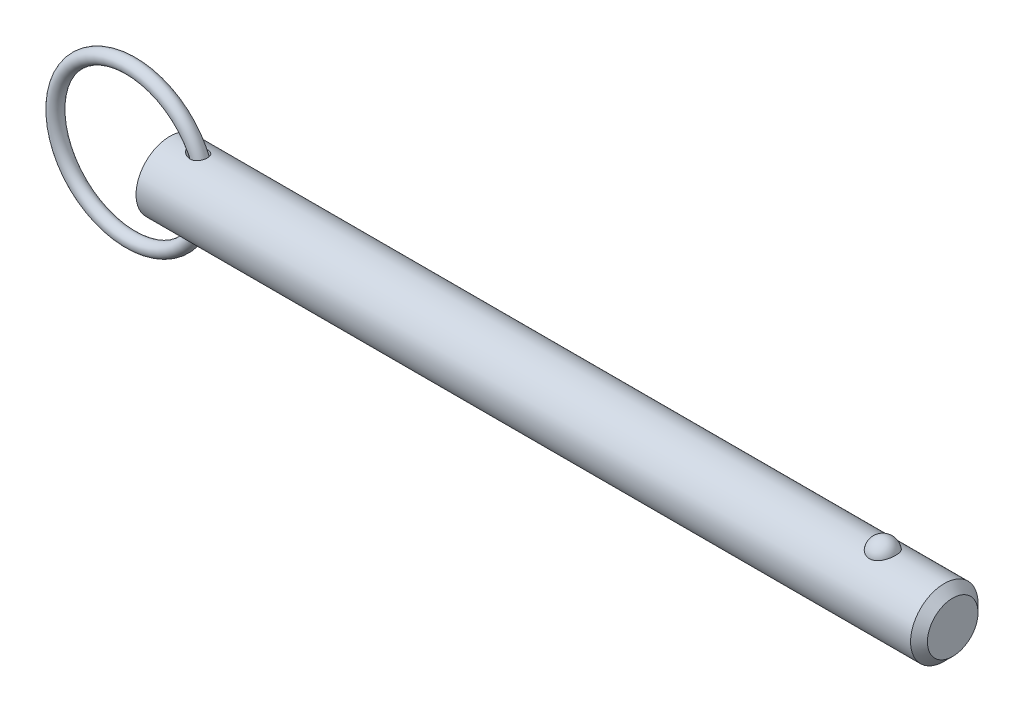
ISO-10303-21;
HEADER;
FILE_DESCRIPTION(('STEP AP214'),'2;1');
FILE_NAME('part.step','',(''),(''),'','','');
FILE_SCHEMA(('AUTOMOTIVE_DESIGN { 1 0 10303 214 1 1 1 1 }'));
ENDSEC;
DATA;
#1=APPLICATION_CONTEXT('core data for automotive mechanical design processes');
#2=APPLICATION_PROTOCOL_DEFINITION('international standard','automotive_design',2000,#1);
#3=PRODUCT_CONTEXT('',#1,'mechanical');
#4=PRODUCT('Part','Part','',(#3));
#5=PRODUCT_RELATED_PRODUCT_CATEGORY('part','',(#4));
#6=PRODUCT_DEFINITION_FORMATION('','',#4);
#7=PRODUCT_DEFINITION_CONTEXT('part definition',#1,'design');
#8=PRODUCT_DEFINITION('design','',#6,#7);
#9=PRODUCT_DEFINITION_SHAPE('','',#8);
#10=(LENGTH_UNIT() NAMED_UNIT(*) SI_UNIT(.MILLI.,.METRE.));
#11=(NAMED_UNIT(*) PLANE_ANGLE_UNIT() SI_UNIT($,.RADIAN.));
#12=(NAMED_UNIT(*) SI_UNIT($,.STERADIAN.) SOLID_ANGLE_UNIT());
#13=UNCERTAINTY_MEASURE_WITH_UNIT(LENGTH_MEASURE(1.E-05),#10,'distance_accuracy_value','');
#14=(GEOMETRIC_REPRESENTATION_CONTEXT(3) GLOBAL_UNCERTAINTY_ASSIGNED_CONTEXT((#13)) GLOBAL_UNIT_ASSIGNED_CONTEXT((#10,
#11,#12)) REPRESENTATION_CONTEXT('',''));
#15=CARTESIAN_POINT('',(0.,0.,0.));
#16=DIRECTION('',(0.,0.,1.));
#17=DIRECTION('',(1.,0.,0.));
#18=AXIS2_PLACEMENT_3D('',#15,#16,#17);
#19=CARTESIAN_POINT('',(-8.23730968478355,0.,0.));
#20=DIRECTION('',(0.,0.,1.));
#21=DIRECTION('',(1.,0.,0.));
#22=AXIS2_PLACEMENT_3D('',#19,#20,#21);
#23=TOROIDAL_SURFACE('',#22,15.875,1.422);
#24=CARTESIAN_POINT('',(9.05969031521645,0.,0.));
#25=VERTEX_POINT('',#24);
#26=VERTEX_LOOP('',#25);
#27=FACE_BOUND('',#26,.T.);
#28=ADVANCED_FACE('P0_F12',(#27),#23,.T.);
#29=CLOSED_SHELL('',(#28));
#30=MANIFOLD_SOLID_BREP('P0_B1',#29);
#31=CARTESIAN_POINT('',(0.,0.,0.));
#32=DIRECTION('',(1.,0.,0.));
#33=DIRECTION('',(0.,0.,-1.));
#34=AXIS2_PLACEMENT_3D('',#31,#32,#33);
#35=CYLINDRICAL_SURFACE('',#34,7.11);
#36=CARTESIAN_POINT('',(3.98467340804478,7.10072679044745,-0.363013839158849));
#37=CARTESIAN_POINT('',(4.00971652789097,7.09600153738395,-0.45539194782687));
#38=CARTESIAN_POINT('',(4.04401947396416,7.08958406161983,-0.545230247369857));
#39=CARTESIAN_POINT('',(4.12810160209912,7.07427055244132,-0.717157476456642));
#40=CARTESIAN_POINT('',(4.17791765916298,7.06536861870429,-0.799227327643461));
#41=CARTESIAN_POINT('',(4.28924471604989,7.04620300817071,-0.953469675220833));
#42=CARTESIAN_POINT('',(4.35063580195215,7.035953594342,-1.02573162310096));
#43=CARTESIAN_POINT('',(4.48282610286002,7.01493313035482,-1.16081412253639));
#44=CARTESIAN_POINT('',(4.55362244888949,7.00416223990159,-1.22363754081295));
#45=CARTESIAN_POINT('',(4.71659336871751,6.98090398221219,-1.35055080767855));
#46=CARTESIAN_POINT('',(4.81029272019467,6.96847103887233,-1.41269256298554));
#47=CARTESIAN_POINT('',(5.0057240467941,6.94515366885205,-1.52319699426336));
#48=CARTESIAN_POINT('',(5.10746392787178,6.93427079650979,-1.57154588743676));
#49=CARTESIAN_POINT('',(5.33503739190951,6.91346066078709,-1.66091325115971));
#50=CARTESIAN_POINT('',(5.46199550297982,6.90402388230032,-1.69921932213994));
#51=CARTESIAN_POINT('',(5.72084799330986,6.89024030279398,-1.75428261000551));
#52=CARTESIAN_POINT('',(5.85274301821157,6.88589416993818,-1.77103699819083));
#53=CARTESIAN_POINT('',(6.11557710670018,6.88337277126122,-1.78081990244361));
#54=CARTESIAN_POINT('',(6.24650031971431,6.88510489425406,-1.77420448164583));
#55=CARTESIAN_POINT('',(6.50446311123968,6.89478744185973,-1.73620392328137));
#56=CARTESIAN_POINT('',(6.6315075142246,6.90272978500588,-1.70485097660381));
#57=CARTESIAN_POINT('',(6.85933269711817,6.92243075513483,-1.62281888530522));
#58=CARTESIAN_POINT('',(6.96133251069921,6.93352131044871,-1.5753580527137));
#59=CARTESIAN_POINT('',(7.15436649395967,6.95824811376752,-1.46226310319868));
#60=CARTESIAN_POINT('',(7.24540699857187,6.97188287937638,-1.3966395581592));
#61=CARTESIAN_POINT('',(7.40446019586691,6.99838217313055,-1.25668991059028));
#62=CARTESIAN_POINT('',(7.473875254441,7.01118308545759,-1.18393777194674));
#63=CARTESIAN_POINT('',(7.59904891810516,7.03582803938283,-1.02736918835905));
#64=CARTESIAN_POINT('',(7.65481029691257,7.04767227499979,-0.943554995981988));
#65=CARTESIAN_POINT('',(7.74982438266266,7.06873077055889,-0.76979592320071));
#66=CARTESIAN_POINT('',(7.7894903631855,7.07800861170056,-0.680084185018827));
#67=CARTESIAN_POINT('',(7.85354088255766,7.09334756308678,-0.495102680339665));
#68=CARTESIAN_POINT('',(7.87792559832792,7.09940871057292,-0.399832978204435));
#69=CARTESIAN_POINT('',(7.9108898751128,7.10766731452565,-0.206294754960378));
#70=CARTESIAN_POINT('',(7.91944662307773,7.10985919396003,-0.108022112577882));
#71=CARTESIAN_POINT('',(7.920501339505,7.11012756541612,0.0886168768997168));
#72=CARTESIAN_POINT('',(7.91299895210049,7.10820396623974,0.186983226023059));
#73=CARTESIAN_POINT('',(7.88205794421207,7.10043733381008,0.381270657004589));
#74=CARTESIAN_POINT('',(7.85857985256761,7.09458459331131,0.477185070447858));
#75=CARTESIAN_POINT('',(7.79617406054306,7.07958431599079,0.663575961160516));
#76=CARTESIAN_POINT('',(7.75724672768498,7.07043685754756,0.754052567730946));
#77=CARTESIAN_POINT('',(7.66496731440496,7.04987259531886,0.926798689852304));
#78=CARTESIAN_POINT('',(7.61164530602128,7.0384605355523,1.00908483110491));
#79=CARTESIAN_POINT('',(7.49191707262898,7.01461776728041,1.16333092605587));
#80=CARTESIAN_POINT('',(7.42551210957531,7.00218715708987,1.235291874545));
#81=CARTESIAN_POINT('',(7.28164031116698,6.97770944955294,1.36680167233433));
#82=CARTESIAN_POINT('',(7.20420170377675,6.96566146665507,1.42638126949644));
#83=CARTESIAN_POINT('',(7.0403906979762,6.94319963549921,1.53199377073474));
#84=CARTESIAN_POINT('',(6.95401827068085,6.93278579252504,1.57802663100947));
#85=CARTESIAN_POINT('',(6.7731858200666,6.91444459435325,1.65656940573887));
#86=CARTESIAN_POINT('',(6.67860569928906,6.90656682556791,1.68881327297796));
#87=CARTESIAN_POINT('',(6.48544119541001,6.89422806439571,1.73849768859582));
#88=CARTESIAN_POINT('',(6.38685561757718,6.88976809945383,1.755933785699));
#89=CARTESIAN_POINT('',(6.18089829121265,6.88429907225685,1.77726234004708));
#90=CARTESIAN_POINT('',(6.07340937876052,6.88356485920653,1.78007646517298));
#91=CARTESIAN_POINT('',(5.85921220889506,6.886086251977,1.77029087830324));
#92=CARTESIAN_POINT('',(5.75250426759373,6.88934339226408,1.75768523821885));
#93=CARTESIAN_POINT('',(5.52848027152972,6.89994454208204,1.71563399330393));
#94=CARTESIAN_POINT('',(5.41155168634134,6.90775772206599,1.68424184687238));
#95=CARTESIAN_POINT('',(5.18376466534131,6.92670168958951,1.60454711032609));
#96=CARTESIAN_POINT('',(5.07291446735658,6.9378368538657,1.5562221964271));
#97=CARTESIAN_POINT('',(4.84835244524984,6.96347168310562,1.43744827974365));
#98=CARTESIAN_POINT('',(4.73562531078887,6.97820486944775,1.36517310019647));
#99=CARTESIAN_POINT('',(4.52504912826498,7.00822340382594,1.20158053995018));
#100=CARTESIAN_POINT('',(4.42717478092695,7.02350775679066,1.11029618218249));
#101=CARTESIAN_POINT('',(4.27935716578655,7.04784659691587,0.940654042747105));
#102=CARTESIAN_POINT('',(4.2239722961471,7.05736064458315,0.867099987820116));
#103=CARTESIAN_POINT('',(4.12558347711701,7.07469854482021,0.711919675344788));
#104=CARTESIAN_POINT('',(4.08256922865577,7.0825238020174,0.630300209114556));
#105=CARTESIAN_POINT('',(4.01142860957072,7.09565978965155,0.459428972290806));
#106=CARTESIAN_POINT('',(3.98346043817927,7.10094374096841,0.370107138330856));
#107=CARTESIAN_POINT('',(3.95517285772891,7.1063173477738,0.233358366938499));
#108=CARTESIAN_POINT('',(3.94802115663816,7.1076831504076,0.187321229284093));
#109=CARTESIAN_POINT('',(3.93842121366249,7.10951900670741,0.0947476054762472));
#110=CARTESIAN_POINT('',(3.93597129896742,7.10998937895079,0.0482113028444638));
#111=CARTESIAN_POINT('',(3.93584361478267,7.11001358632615,-0.0598597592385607));
#112=CARTESIAN_POINT('',(3.9399538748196,7.10922402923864,-0.121405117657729));
#113=CARTESIAN_POINT('',(3.95632793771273,7.10609781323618,-0.243320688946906));
#114=CARTESIAN_POINT('',(3.96859135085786,7.10376122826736,-0.303690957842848));
#115=CARTESIAN_POINT('',(3.98467340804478,7.10072679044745,-0.363013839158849));
#116=B_SPLINE_CURVE_WITH_KNOTS('',3,(#36,#37,#38,#39,#40,#41,#42,#43,#44,#45,#46,#47,#48,#49,
#50,#51,#52,#53,#54,#55,#56,#57,#58,#59,#60,#61,#62,#63,#64,#65,#66,#67,#68,#69,#70,#71,#72,#73,
#74,#75,#76,#77,#78,#79,#80,#81,#82,#83,#84,#85,#86,#87,#88,#89,#90,#91,#92,#93,#94,#95,#96,#97,
#98,#99,#100,#101,#102,#103,#104,#105,#106,#107,#108,#109,#110,#111,#112,#113,#114,#115),
.UNSPECIFIED.,.T.,.F.,(4,2,2,2,2,2,2,2,2,2,2,2,2,2,2,2,2,2,2,2,2,2,2,2,2,2,2,2,2,2,2,2,2,2,2,2,
2,2,2,4),(0.,0.287206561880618,0.575101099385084,0.860162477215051,1.14513709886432,
1.48324846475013,1.82169652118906,2.21865672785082,2.6156690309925,3.00665870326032,
3.39714041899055,3.73437585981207,4.07141541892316,4.37402271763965,4.67656849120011,
4.97076150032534,5.26495110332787,5.55956439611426,5.85418421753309,6.14953461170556,
6.44487798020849,6.73960905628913,7.03431171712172,7.32827352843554,7.6222362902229,
7.9216396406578,8.22113296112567,8.54242840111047,8.86384740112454,9.22635035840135,
9.58933304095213,9.99153142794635,10.3930368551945,10.6697219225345,10.9461759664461,
11.2254825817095,11.3650959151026,11.5046595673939,11.6891051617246,11.8735419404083),.UNSPECIFIED.);
#117=CARTESIAN_POINT('',(3.98467340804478,7.10072679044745,-0.363013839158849));
#118=VERTEX_POINT('',#117);
#119=EDGE_CURVE('P1_E40',#118,#118,#116,.T.);
#120=ORIENTED_EDGE('',*,*,#119,.T.);
#121=EDGE_LOOP('',(#120));
#122=FACE_BOUND('',#121,.T.);
#123=CARTESIAN_POINT('',(163.2925,0.,0.));
#124=DIRECTION('',(1.,0.,0.));
#125=DIRECTION('',(0.,0.,-1.));
#126=AXIS2_PLACEMENT_3D('',#123,#124,#125);
#127=CIRCLE('',#126,7.11);
#128=CARTESIAN_POINT('',(163.2925,0.,-7.11));
#129=VERTEX_POINT('',#128);
#130=EDGE_CURVE('P1_E25',#129,#129,#127,.T.);
#131=ORIENTED_EDGE('',*,*,#130,.F.);
#132=EDGE_LOOP('',(#131));
#133=FACE_BOUND('',#132,.T.);
#134=CARTESIAN_POINT('',(0.,0.,0.));
#135=DIRECTION('',(1.,0.,0.));
#136=DIRECTION('',(0.,0.,-1.));
#137=AXIS2_PLACEMENT_3D('',#134,#135,#136);
#138=CIRCLE('',#137,7.11);
#139=CARTESIAN_POINT('',(0.,0.,-7.11));
#140=VERTEX_POINT('',#139);
#141=EDGE_CURVE('P1_E9',#140,#140,#138,.T.);
#142=ORIENTED_EDGE('',*,*,#141,.T.);
#143=EDGE_LOOP('',(#142));
#144=FACE_BOUND('',#143,.T.);
#145=CARTESIAN_POINT('',(150.329258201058,6.5364666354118,2.79762469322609));
#146=CARTESIAN_POINT('',(150.184429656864,6.53647876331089,2.79761243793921));
#147=CARTESIAN_POINT('',(150.039368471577,6.54144531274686,2.78608115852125));
#148=CARTESIAN_POINT('',(149.753292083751,6.56077791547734,2.7402328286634));
#149=CARTESIAN_POINT('',(149.61228845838,6.5751685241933,2.7058562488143));
#150=CARTESIAN_POINT('',(149.33888335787,6.61165072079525,2.61544042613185));
#151=CARTESIAN_POINT('',(149.206460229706,6.63372195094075,2.55945840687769));
#152=CARTESIAN_POINT('',(148.953233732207,6.6831601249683,2.42742958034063));
#153=CARTESIAN_POINT('',(148.832425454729,6.71052481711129,2.35139129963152));
#154=CARTESIAN_POINT('',(148.601637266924,6.76860821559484,2.17866150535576));
#155=CARTESIAN_POINT('',(148.492085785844,6.79940242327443,2.0814234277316));
#156=CARTESIAN_POINT('',(148.29033404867,6.86050242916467,1.87020907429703));
#157=CARTESIAN_POINT('',(148.198139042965,6.89080807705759,1.75622775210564));
#158=CARTESIAN_POINT('',(148.02925478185,6.94923069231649,1.50900646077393));
#159=CARTESIAN_POINT('',(147.953428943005,6.97719213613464,1.3751387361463));
#160=CARTESIAN_POINT('',(147.824206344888,7.02647251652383,1.09584817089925));
#161=CARTESIAN_POINT('',(147.770810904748,7.04779106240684,0.950424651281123));
#162=CARTESIAN_POINT('',(147.687101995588,7.08180248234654,0.650508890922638));
#163=CARTESIAN_POINT('',(147.657025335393,7.09440672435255,0.495940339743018));
#164=CARTESIAN_POINT('',(147.621473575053,7.10935121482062,0.183515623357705));
#165=CARTESIAN_POINT('',(147.615997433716,7.11169189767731,0.025659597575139));
#166=CARTESIAN_POINT('',(147.629700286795,7.10589702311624,-0.287512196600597));
#167=CARTESIAN_POINT('',(147.64868231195,7.0978451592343,-0.442838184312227));
#168=CARTESIAN_POINT('',(147.71057450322,7.07221860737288,-0.747830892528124));
#169=CARTESIAN_POINT('',(147.753485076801,7.05464375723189,-0.897497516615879));
#170=CARTESIAN_POINT('',(147.862452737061,7.01171031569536,-1.18722864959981));
#171=CARTESIAN_POINT('',(147.928545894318,6.98633960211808,-1.32727778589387));
#172=CARTESIAN_POINT('',(148.082536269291,6.93042258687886,-1.59370324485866));
#173=CARTESIAN_POINT('',(148.170435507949,6.89987580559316,-1.72007829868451));
#174=CARTESIAN_POINT('',(148.366926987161,6.83659510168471,-1.95657345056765));
#175=CARTESIAN_POINT('',(148.475664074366,6.80384697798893,-2.0665695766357));
#176=CARTESIAN_POINT('',(148.710968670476,6.7400183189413,-2.26611005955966));
#177=CARTESIAN_POINT('',(148.837535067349,6.70893767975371,-2.35565569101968));
#178=CARTESIAN_POINT('',(149.102845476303,6.65264442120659,-2.51019726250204));
#179=CARTESIAN_POINT('',(149.241323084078,6.62733449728,-2.57561395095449));
#180=CARTESIAN_POINT('',(149.528519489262,6.58495995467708,-2.68211134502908));
#181=CARTESIAN_POINT('',(149.677234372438,6.56789220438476,-2.7232012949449));
#182=CARTESIAN_POINT('',(149.972626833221,6.54478663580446,-2.7782581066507));
#183=CARTESIAN_POINT('',(150.11902951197,6.53823639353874,-2.79348727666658));
#184=CARTESIAN_POINT('',(150.412470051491,6.53532718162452,-2.80028921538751));
#185=CARTESIAN_POINT('',(150.559507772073,6.53896606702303,-2.7918669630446));
#186=CARTESIAN_POINT('',(150.844921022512,6.55570357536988,-2.75232178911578));
#187=CARTESIAN_POINT('',(150.983422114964,6.56848455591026,-2.72196077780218));
#188=CARTESIAN_POINT('',(151.253114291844,6.60173528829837,-2.64028774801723));
#189=CARTESIAN_POINT('',(151.384304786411,6.62220565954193,-2.58897404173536));
#190=CARTESIAN_POINT('',(151.638846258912,6.66917927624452,-2.46547820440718));
#191=CARTESIAN_POINT('',(151.761969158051,6.69580233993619,-2.39287266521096));
#192=CARTESIAN_POINT('',(151.994441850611,6.75207041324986,-2.22915269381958));
#193=CARTESIAN_POINT('',(152.103788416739,6.78171612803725,-2.13803393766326));
#194=CARTESIAN_POINT('',(152.311642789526,6.84264629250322,-1.93445592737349));
#195=CARTESIAN_POINT('',(152.409317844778,6.87393748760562,-1.82114774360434));
#196=CARTESIAN_POINT('',(152.585011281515,6.93345710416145,-1.57947787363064));
#197=CARTESIAN_POINT('',(152.663026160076,6.96168497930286,-1.45111351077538));
#198=CARTESIAN_POINT('',(152.799985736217,7.01307558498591,-1.17842708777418));
#199=CARTESIAN_POINT('',(152.858258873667,7.03605262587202,-1.03373189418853));
#200=CARTESIAN_POINT('',(152.951081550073,7.07340932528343,-0.735867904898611));
#201=CARTESIAN_POINT('',(152.985631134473,7.08778900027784,-0.582699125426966));
#202=CARTESIAN_POINT('',(153.030274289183,7.10647639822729,-0.272420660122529));
#203=CARTESIAN_POINT('',(153.04039710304,7.11079616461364,-0.115315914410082));
#204=CARTESIAN_POINT('',(153.036061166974,7.10896059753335,0.198488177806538));
#205=CARTESIAN_POINT('',(153.021603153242,7.10280557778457,0.355187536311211));
#206=CARTESIAN_POINT('',(152.968572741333,7.08071500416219,0.662724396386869));
#207=CARTESIAN_POINT('',(152.93015058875,7.06484039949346,0.813592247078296));
#208=CARTESIAN_POINT('',(152.830101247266,7.0249589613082,1.10629159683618));
#209=CARTESIAN_POINT('',(152.768472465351,7.00095156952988,1.24812247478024));
#210=CARTESIAN_POINT('',(152.622766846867,6.94706632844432,1.51976439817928));
#211=CARTESIAN_POINT('',(152.538544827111,6.91715085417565,1.6494901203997));
#212=CARTESIAN_POINT('',(152.349586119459,6.85470565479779,1.89231285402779));
#213=CARTESIAN_POINT('',(152.244850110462,6.82217601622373,2.0054104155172));
#214=CARTESIAN_POINT('',(152.017103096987,6.75805358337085,2.21190674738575));
#215=CARTESIAN_POINT('',(151.894082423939,6.72646129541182,2.30529503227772));
#216=CARTESIAN_POINT('',(151.63273470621,6.66789520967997,2.46959908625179));
#217=CARTESIAN_POINT('',(151.494401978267,6.64092313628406,2.54050647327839));
#218=CARTESIAN_POINT('',(151.211182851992,6.5957258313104,2.65560045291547));
#219=CARTESIAN_POINT('',(151.066666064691,6.57724013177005,2.70059539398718));
#220=CARTESIAN_POINT('',(150.771546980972,6.55006426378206,2.76587321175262));
#221=CARTESIAN_POINT('',(150.620964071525,6.54134511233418,2.78622922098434));
#222=CARTESIAN_POINT('',(150.423046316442,6.53697847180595,2.79642434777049));
#223=CARTESIAN_POINT('',(150.376164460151,6.53646270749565,2.79762866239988));
#224=CARTESIAN_POINT('',(150.329258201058,6.5364666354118,2.79762469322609));
#225=B_SPLINE_CURVE_WITH_KNOTS('',3,(#145,#146,#147,#148,#149,#150,#151,#152,#153,#154,#155,
#156,#157,#158,#159,#160,#161,#162,#163,#164,#165,#166,#167,#168,#169,#170,#171,#172,#173,#174,
#175,#176,#177,#178,#179,#180,#181,#182,#183,#184,#185,#186,#187,#188,#189,#190,#191,#192,#193,
#194,#195,#196,#197,#198,#199,#200,#201,#202,#203,#204,#205,#206,#207,#208,#209,#210,#211,#212,
#213,#214,#215,#216,#217,#218,#219,#220,#221,#222,#223,#224),.UNSPECIFIED.,.T.,.F.,(4,2,2,2,2,2,
2,2,2,2,2,2,2,2,2,2,2,2,2,2,2,2,2,2,2,2,2,2,2,2,2,2,2,2,2,2,2,2,2,4),(0.,0.43435572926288,
0.86984774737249,1.30419416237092,1.73835621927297,2.18541922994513,2.63261726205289,
3.09954261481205,3.56649542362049,4.03813031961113,4.50974525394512,4.97758575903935,
5.44543423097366,5.91401389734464,6.38263700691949,6.85464418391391,7.32662193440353,
7.7899297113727,8.25306131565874,8.69285754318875,9.13256119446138,9.55768625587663,
9.98284556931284,10.4171106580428,10.8514772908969,11.3079089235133,11.7644218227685,
12.2351898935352,12.7059570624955,13.1761603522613,13.6463495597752,14.1136200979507,
14.580922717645,15.0513032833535,15.5216682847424,15.9922828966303,16.4630727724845,
16.9182457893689,17.372064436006,17.5127411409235),.UNSPECIFIED.);
#226=CARTESIAN_POINT('',(150.329258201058,6.5364666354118,2.79762469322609));
#227=VERTEX_POINT('',#226);
#228=EDGE_CURVE('P1_E34',#227,#227,#225,.T.);
#229=ORIENTED_EDGE('',*,*,#228,.T.);
#230=EDGE_LOOP('',(#229));
#231=FACE_BOUND('',#230,.T.);
#232=CARTESIAN_POINT('',(3.98467340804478,-7.10072679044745,-0.363013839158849));
#233=CARTESIAN_POINT('',(3.96426456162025,-7.10457733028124,-0.287714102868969));
#234=CARTESIAN_POINT('',(3.95000501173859,-7.10730349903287,-0.210695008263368));
#235=CARTESIAN_POINT('',(3.93481801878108,-7.11020840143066,-0.0553038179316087));
#236=CARTESIAN_POINT('',(3.93388435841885,-7.11038832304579,0.0230676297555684));
#237=CARTESIAN_POINT('',(3.94541910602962,-7.10817995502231,0.178714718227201));
#238=CARTESIAN_POINT('',(3.95787987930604,-7.10579312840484,0.25599095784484));
#239=CARTESIAN_POINT('',(3.99523775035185,-7.09872642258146,0.407352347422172));
#240=CARTESIAN_POINT('',(4.02014065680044,-7.09404547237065,0.481435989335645));
#241=CARTESIAN_POINT('',(4.08119600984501,-7.08278363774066,0.625775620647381));
#242=CARTESIAN_POINT('',(4.11749458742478,-7.07617815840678,0.695967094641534));
#243=CARTESIAN_POINT('',(4.19940836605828,-7.06165305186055,0.830508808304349));
#244=CARTESIAN_POINT('',(4.24502952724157,-7.0537325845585,0.894855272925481));
#245=CARTESIAN_POINT('',(4.36790232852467,-7.03310314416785,1.04688574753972));
#246=CARTESIAN_POINT('',(4.44977459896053,-7.01993229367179,1.13078695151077));
#247=CARTESIAN_POINT('',(4.62610796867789,-6.99351259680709,1.28411726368));
#248=CARTESIAN_POINT('',(4.7205898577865,-6.98026365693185,1.35352197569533));
#249=CARTESIAN_POINT('',(4.92036507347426,-6.9549104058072,1.47831921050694));
#250=CARTESIAN_POINT('',(5.02579054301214,-6.94282458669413,1.53350332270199));
#251=CARTESIAN_POINT('',(5.24378330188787,-6.92129098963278,1.62793610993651));
#252=CARTESIAN_POINT('',(5.35635066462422,-6.91184323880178,1.66718462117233));
#253=CARTESIAN_POINT('',(5.60134354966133,-6.89573491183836,1.73269893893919));
#254=CARTESIAN_POINT('',(5.73444697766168,-6.8895970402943,1.75661057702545));
#255=CARTESIAN_POINT('',(6.00300738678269,-6.88344616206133,1.78057487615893));
#256=CARTESIAN_POINT('',(6.13846360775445,-6.88343121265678,1.78063510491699));
#257=CARTESIAN_POINT('',(6.39660470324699,-6.88981379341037,1.75576480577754));
#258=CARTESIAN_POINT('',(6.51947843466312,-6.89572457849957,1.73273121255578));
#259=CARTESIAN_POINT('',(6.75813770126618,-6.91274434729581,1.66352936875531));
#260=CARTESIAN_POINT('',(6.87393155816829,-6.92384709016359,1.61738888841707));
#261=CARTESIAN_POINT('',(7.07801861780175,-6.94787316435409,1.51052664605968));
#262=CARTESIAN_POINT('',(7.16789841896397,-6.96033024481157,1.45271574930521));
#263=CARTESIAN_POINT('',(7.33546773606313,-6.98638661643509,1.32171912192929));
#264=CARTESIAN_POINT('',(7.41316182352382,-6.99998547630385,1.24853918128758));
#265=CARTESIAN_POINT('',(7.54861420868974,-7.02559503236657,1.09486170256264));
#266=CARTESIAN_POINT('',(7.60741145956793,-7.03764930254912,1.01528346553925));
#267=CARTESIAN_POINT('',(7.71070740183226,-7.0598657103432,0.847099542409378));
#268=CARTESIAN_POINT('',(7.75520788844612,-7.0700280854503,0.758494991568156));
#269=CARTESIAN_POINT('',(7.82836147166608,-7.08722075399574,0.575936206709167));
#270=CARTESIAN_POINT('',(7.85719783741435,-7.09428707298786,0.482058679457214));
#271=CARTESIAN_POINT('',(7.89918378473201,-7.10470260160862,0.29065874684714));
#272=CARTESIAN_POINT('',(7.91233308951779,-7.10805174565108,0.193136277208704));
#273=CARTESIAN_POINT('',(7.92267451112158,-7.11067890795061,-0.00313968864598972));
#274=CARTESIAN_POINT('',(7.91981203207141,-7.10994299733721,-0.10189624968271));
#275=CARTESIAN_POINT('',(7.89806489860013,-7.10444651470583,-0.297516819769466));
#276=CARTESIAN_POINT('',(7.87918005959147,-7.09968589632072,-0.394380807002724));
#277=CARTESIAN_POINT('',(7.82577988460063,-7.0866471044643,-0.58355375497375));
#278=CARTESIAN_POINT('',(7.79124976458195,-7.07836560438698,-0.675858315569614));
#279=CARTESIAN_POINT('',(7.70736343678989,-7.05919003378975,-0.853167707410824));
#280=CARTESIAN_POINT('',(7.65800801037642,-7.04829610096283,-0.938172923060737));
#281=CARTESIAN_POINT('',(7.54590141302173,-7.02513961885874,-1.09819812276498));
#282=CARTESIAN_POINT('',(7.48319521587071,-7.01288172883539,-1.17325029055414));
#283=CARTESIAN_POINT('',(7.34599775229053,-6.98832192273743,-1.31164333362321));
#284=CARTESIAN_POINT('',(7.27150757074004,-6.97602001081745,-1.37498528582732));
#285=CARTESIAN_POINT('',(7.11277776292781,-6.95268608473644,-1.48849974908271));
#286=CARTESIAN_POINT('',(7.02852525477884,-6.94165578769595,-1.53865456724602));
#287=CARTESIAN_POINT('',(6.85282430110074,-6.92200320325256,-1.62478650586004));
#288=CARTESIAN_POINT('',(6.76137511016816,-6.91338116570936,-1.66076215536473));
#289=CARTESIAN_POINT('',(6.57061179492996,-6.89906044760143,-1.71930563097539));
#290=CARTESIAN_POINT('',(6.47113516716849,-6.89347290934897,-1.74136795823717));
#291=CARTESIAN_POINT('',(6.26989833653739,-6.88605020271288,-1.7704895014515));
#292=CARTESIAN_POINT('',(6.16813737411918,-6.88421630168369,-1.77754365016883));
#293=CARTESIAN_POINT('',(5.95492537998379,-6.88424071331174,-1.77745174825));
#294=CARTESIAN_POINT('',(5.8434768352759,-6.88646827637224,-1.76888555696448));
#295=CARTESIAN_POINT('',(5.62307560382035,-6.89483827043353,-1.73596677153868));
#296=CARTESIAN_POINT('',(5.51412477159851,-6.90098351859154,-1.71160281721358));
#297=CARTESIAN_POINT('',(5.28644478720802,-6.91743803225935,-1.64393691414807));
#298=CARTESIAN_POINT('',(5.16837217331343,-6.92819628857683,-1.59852806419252));
#299=CARTESIAN_POINT('',(4.94091825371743,-6.95234836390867,-1.4899796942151));
#300=CARTESIAN_POINT('',(4.83153887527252,-6.96574276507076,-1.42683625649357));
#301=CARTESIAN_POINT('',(4.63576710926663,-6.99209234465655,-1.29112257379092));
#302=CARTESIAN_POINT('',(4.54816728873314,-7.00494184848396,-1.22027748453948));
#303=CARTESIAN_POINT('',(4.38554897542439,-7.03019055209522,-1.0652111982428));
#304=CARTESIAN_POINT('',(4.31052141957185,-7.04259007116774,-0.980999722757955));
#305=CARTESIAN_POINT('',(4.18551811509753,-7.0640229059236,-0.811206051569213));
#306=CARTESIAN_POINT('',(4.13358417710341,-7.07328321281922,-0.727107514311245));
#307=CARTESIAN_POINT('',(4.04607461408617,-7.0891994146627,-0.550580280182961));
#308=CARTESIAN_POINT('',(4.01046401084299,-7.09586087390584,-0.458169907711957));
#309=CARTESIAN_POINT('',(3.98467340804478,-7.10072679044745,-0.363013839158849));
#310=B_SPLINE_CURVE_WITH_KNOTS('',3,(#232,#233,#234,#235,#236,#237,#238,#239,#240,#241,#242,
#243,#244,#245,#246,#247,#248,#249,#250,#251,#252,#253,#254,#255,#256,#257,#258,#259,#260,#261,
#262,#263,#264,#265,#266,#267,#268,#269,#270,#271,#272,#273,#274,#275,#276,#277,#278,#279,#280,
#281,#282,#283,#284,#285,#286,#287,#288,#289,#290,#291,#292,#293,#294,#295,#296,#297,#298,#299,
#300,#301,#302,#303,#304,#305,#306,#307,#308,#309),.UNSPECIFIED.,.T.,.F.,(4,2,2,2,2,2,2,2,2,2,2,
2,2,2,2,2,2,2,2,2,2,2,2,2,2,2,2,2,2,2,2,2,2,2,2,2,2,2,4),(0.,0.23402065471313,0.467932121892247,
0.701710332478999,0.935597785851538,1.17261620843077,1.40978663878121,1.76177576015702,
2.11435255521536,2.47183528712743,2.8293216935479,3.23332937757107,3.63720887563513,
4.01042610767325,4.38319587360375,4.70425151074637,5.02518641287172,5.32277979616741,
5.62033579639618,5.91433101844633,6.2083314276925,6.50333490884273,6.79834178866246,
7.09362801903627,7.38889868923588,7.6831900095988,7.9774542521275,8.27211131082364,
8.56679892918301,8.8716552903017,9.17661456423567,9.51069129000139,9.84500851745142,
10.2243046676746,10.6036846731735,10.9425776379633,11.2812252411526,11.5775945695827,
11.8733258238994),.UNSPECIFIED.);
#311=CARTESIAN_POINT('',(3.98467340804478,-7.10072679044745,-0.363013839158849));
#312=VERTEX_POINT('',#311);
#313=EDGE_CURVE('P1_E17',#312,#312,#310,.T.);
#314=ORIENTED_EDGE('',*,*,#313,.T.);
#315=EDGE_LOOP('',(#314));
#316=FACE_BOUND('',#315,.T.);
#317=ADVANCED_FACE('P1_F13',(#122,#133,#144,#231,#316),#35,.T.);
#318=CARTESIAN_POINT('',(0.,0.,0.));
#319=DIRECTION('',(-1.,0.,0.));
#320=DIRECTION('',(0.,0.,1.));
#321=AXIS2_PLACEMENT_3D('',#318,#319,#320);
#322=PLANE('',#321);
#323=ORIENTED_EDGE('',*,*,#141,.F.);
#324=EDGE_LOOP('',(#323));
#325=FACE_BOUND('',#324,.T.);
#326=ADVANCED_FACE('P1_F15',(#325),#322,.T.);
#327=CARTESIAN_POINT('',(165.07,0.,0.));
#328=DIRECTION('',(-1.,0.,0.));
#329=DIRECTION('',(0.,0.,1.));
#330=AXIS2_PLACEMENT_3D('',#327,#328,#329);
#331=CONICAL_SURFACE('',#330,5.33250000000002,0.785398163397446);
#332=ORIENTED_EDGE('',*,*,#130,.T.);
#333=EDGE_LOOP('',(#332));
#334=FACE_BOUND('',#333,.T.);
#335=CARTESIAN_POINT('',(165.07,0.,0.));
#336=DIRECTION('',(1.,0.,0.));
#337=DIRECTION('',(0.,0.,-1.));
#338=AXIS2_PLACEMENT_3D('',#335,#336,#337);
#339=CIRCLE('',#338,5.33250000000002);
#340=CARTESIAN_POINT('',(165.07,0.,-5.33250000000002));
#341=VERTEX_POINT('',#340);
#342=EDGE_CURVE('P1_E30',#341,#341,#339,.T.);
#343=ORIENTED_EDGE('',*,*,#342,.F.);
#344=EDGE_LOOP('',(#343));
#345=FACE_BOUND('',#344,.T.);
#346=ADVANCED_FACE('P1_F55',(#334,#345),#331,.T.);
#347=CARTESIAN_POINT('',(165.07,5.33250000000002,0.));
#348=DIRECTION('',(1.,0.,0.));
#349=DIRECTION('',(0.,0.,-1.));
#350=AXIS2_PLACEMENT_3D('',#347,#348,#349);
#351=PLANE('',#350);
#352=ORIENTED_EDGE('',*,*,#342,.T.);
#353=EDGE_LOOP('',(#352));
#354=FACE_BOUND('',#353,.T.);
#355=ADVANCED_FACE('P1_F51',(#354),#351,.T.);
#356=CARTESIAN_POINT('',(150.329258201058,6.399,0.));
#357=DIRECTION('',(-1.,0.,0.));
#358=DIRECTION('',(0.,1.,0.));
#359=AXIS2_PLACEMENT_3D('',#356,#357,#358);
#360=SPHERICAL_SURFACE('',#359,2.80099999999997);
#361=ORIENTED_EDGE('',*,*,#228,.F.);
#362=EDGE_LOOP('',(#361));
#363=FACE_BOUND('',#362,.T.);
#364=ADVANCED_FACE('P1_F46',(#363),#360,.T.);
#365=CARTESIAN_POINT('',(-8.23730968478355,0.,0.));
#366=DIRECTION('',(0.,0.,1.));
#367=DIRECTION('',(1.,0.,0.));
#368=AXIS2_PLACEMENT_3D('',#365,#366,#367);
#369=TOROIDAL_SURFACE('',#368,15.875,1.7775);
#370=ORIENTED_EDGE('',*,*,#313,.F.);
#371=EDGE_LOOP('',(#370));
#372=FACE_BOUND('',#371,.T.);
#373=ORIENTED_EDGE('',*,*,#119,.F.);
#374=EDGE_LOOP('',(#373));
#375=FACE_BOUND('',#374,.T.);
#376=ADVANCED_FACE('P1_F50',(#372,#375),#369,.F.);
#377=CLOSED_SHELL('',(#317,#326,#346,#355,#364,#376));
#378=MANIFOLD_SOLID_BREP('P1_B1',#377);
#379=ADVANCED_BREP_SHAPE_REPRESENTATION('',(#18,#30,#378),#14);
#380=SHAPE_DEFINITION_REPRESENTATION(#9,#379);
ENDSEC;
END-ISO-10303-21;
